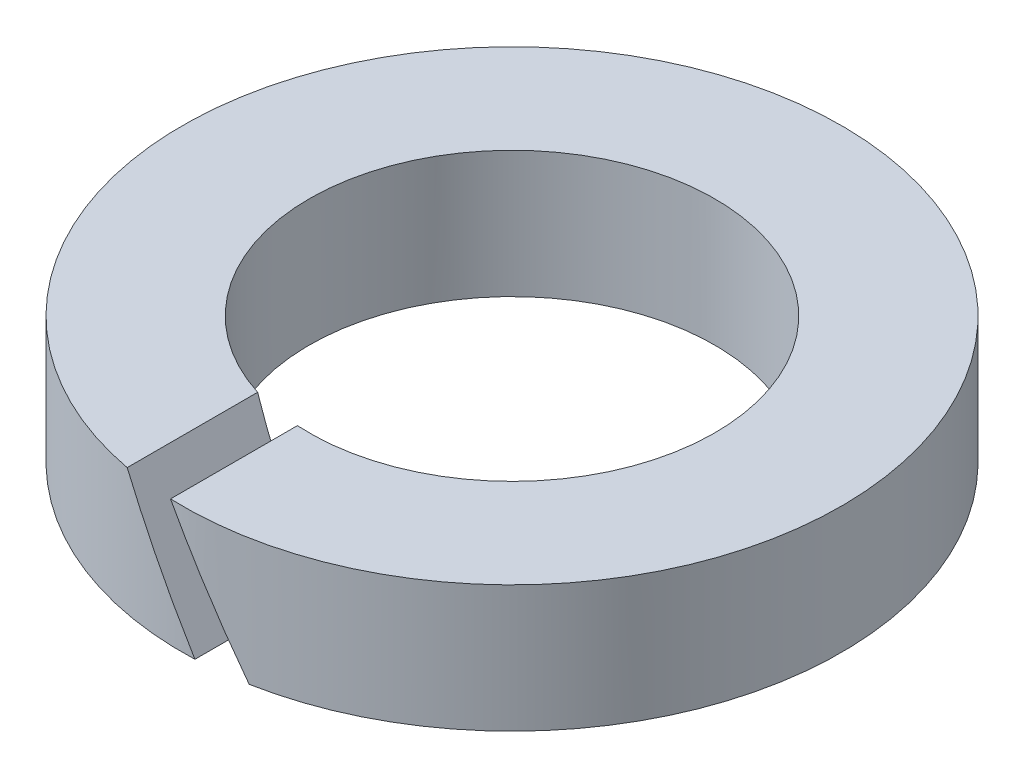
from build123d import *

# Parameters (mm, degrees)
SECTION_2_W      = 2
SECTION_2_H      = 2
FENTE_REACH      = 9.526
FENTE_END_RADIUS = 5.2


with BuildPart() as part:
    # section 2 → R_volution (revolve)
    with BuildSketch(Plane.XY, mode=Mode.PRIVATE) as r_volution_sk:
        with Locations((4.2, 0)):
            Rectangle(SECTION_2_W, SECTION_2_H)
    revolve(r_volution_sk.sketch.rotate(Axis((0, 80, 0), (0, -1, 0)), 90), axis=Axis((0, 80, 0), (0, -1, 0)))

    # fente: up to this cylinder (the profile starts inside it)
    fente_end = Plane(origin=(0, 0, 0), z_dir=(0, 1, 0)) * Cylinder(FENTE_END_RADIUS, 30.452, mode=Mode.PRIVATE)
    # Sketch2 → fente (cut, up to the surface)
    with BuildSketch(Plane(origin=(0, 0.6, 0), x_dir=(-1, 0, 0), z_dir=(0, 0, -1)), mode=Mode.PRIVATE) as fente_sk1:
        Polygon((-0.962250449, -1.6), (0.19245009, 0.4), (0.962250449, 0.4), (-0.19245009, -1.6), align=None)
    fente_tool1 = extrude(fente_sk1.sketch, amount=-FENTE_REACH, mode=Mode.PRIVATE) & fente_end
    add(fente_tool1.solids().sort_by_distance((0, 0, 0))[0], mode=Mode.SUBTRACT)


solid = part.part
